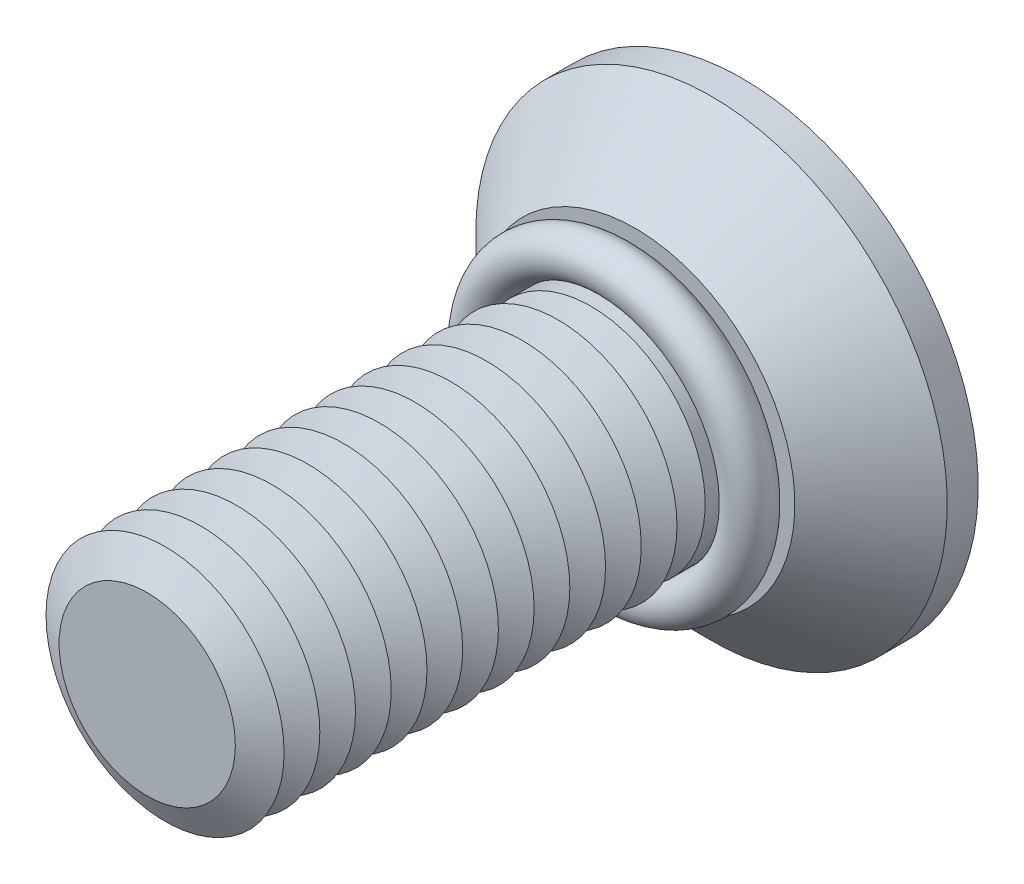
ISO-10303-21;
HEADER;
FILE_DESCRIPTION(('STEP AP214'),'2;1');
FILE_NAME('part.step','',(''),(''),'','','');
FILE_SCHEMA(('AUTOMOTIVE_DESIGN { 1 0 10303 214 1 1 1 1 }'));
ENDSEC;
DATA;
#1=APPLICATION_CONTEXT('core data for automotive mechanical design processes');
#2=APPLICATION_PROTOCOL_DEFINITION('international standard','automotive_design',2000,#1);
#3=PRODUCT_CONTEXT('',#1,'mechanical');
#4=PRODUCT('Part','Part','',(#3));
#5=PRODUCT_RELATED_PRODUCT_CATEGORY('part','',(#4));
#6=PRODUCT_DEFINITION_FORMATION('','',#4);
#7=PRODUCT_DEFINITION_CONTEXT('part definition',#1,'design');
#8=PRODUCT_DEFINITION('design','',#6,#7);
#9=PRODUCT_DEFINITION_SHAPE('','',#8);
#10=(LENGTH_UNIT() NAMED_UNIT(*) SI_UNIT(.MILLI.,.METRE.));
#11=(NAMED_UNIT(*) PLANE_ANGLE_UNIT() SI_UNIT($,.RADIAN.));
#12=(NAMED_UNIT(*) SI_UNIT($,.STERADIAN.) SOLID_ANGLE_UNIT());
#13=UNCERTAINTY_MEASURE_WITH_UNIT(LENGTH_MEASURE(1.E-05),#10,'distance_accuracy_value','');
#14=(GEOMETRIC_REPRESENTATION_CONTEXT(3) GLOBAL_UNCERTAINTY_ASSIGNED_CONTEXT((#13)) GLOBAL_UNIT_ASSIGNED_CONTEXT((#10,
#11,#12)) REPRESENTATION_CONTEXT('',''));
#15=CARTESIAN_POINT('',(0.,0.,0.));
#16=DIRECTION('',(0.,0.,1.));
#17=DIRECTION('',(1.,0.,0.));
#18=AXIS2_PLACEMENT_3D('',#15,#16,#17);
#19=CARTESIAN_POINT('',(0.,0.,5.39999999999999));
#20=DIRECTION('',(0.,0.,1.));
#21=DIRECTION('',(1.,0.,0.));
#22=AXIS2_PLACEMENT_3D('',#19,#20,#21);
#23=TOROIDAL_SURFACE('',#22,5.7,0.9);
#24=CARTESIAN_POINT('',(0.,5.7,5.39999999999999));
#25=DIRECTION('',(1.,0.,0.));
#26=DIRECTION('',(0.,0.,-1.));
#27=AXIS2_PLACEMENT_3D('',#24,#25,#26);
#28=CIRCLE('',#27,0.9);
#29=CARTESIAN_POINT('',(0.,6.6,5.39999999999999));
#30=VERTEX_POINT('',#29);
#31=EDGE_CURVE('P0_E10',#30,#30,#28,.T.);
#32=CARTESIAN_POINT('',(0.,0.,5.39999999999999));
#33=DIRECTION('',(0.,0.,1.));
#34=DIRECTION('',(1.,0.,0.));
#35=AXIS2_PLACEMENT_3D('',#32,#33,#34);
#36=CIRCLE('',#35,6.6);
#37=EDGE_CURVE('',#30,#30,#36,.T.);
#38=ORIENTED_EDGE('',*,*,#31,.F.);
#39=ORIENTED_EDGE('',*,*,#31,.T.);
#40=ORIENTED_EDGE('',*,*,#37,.T.);
#41=ORIENTED_EDGE('',*,*,#37,.F.);
#42=EDGE_LOOP('',(#38,#40,#39,#41));
#43=FACE_BOUND('',#42,.T.);
#44=ADVANCED_FACE('P0_F14',(#43),#23,.T.);
#45=CLOSED_SHELL('',(#44));
#46=MANIFOLD_SOLID_BREP('P0_B1',#45);
#47=CARTESIAN_POINT('',(0.,0.,17.5));
#48=DIRECTION('',(0.,0.,-1.));
#49=DIRECTION('',(-1.,0.,0.));
#50=AXIS2_PLACEMENT_3D('',#47,#48,#49);
#51=CONICAL_SURFACE('',#50,3.70096189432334,1.0471975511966);
#52=CARTESIAN_POINT('',(0.,0.,16.75));
#53=DIRECTION('',(0.,0.,1.));
#54=DIRECTION('',(1.,0.,0.));
#55=AXIS2_PLACEMENT_3D('',#52,#53,#54);
#56=CIRCLE('',#55,5.);
#57=CARTESIAN_POINT('',(5.,0.,16.75));
#58=VERTEX_POINT('',#57);
#59=EDGE_CURVE('P1_E324',#58,#58,#56,.T.);
#60=ORIENTED_EDGE('',*,*,#59,.T.);
#61=EDGE_LOOP('',(#60));
#62=FACE_BOUND('',#61,.T.);
#63=CARTESIAN_POINT('',(0.,0.,17.5));
#64=DIRECTION('',(0.,0.,1.));
#65=DIRECTION('',(1.,0.,0.));
#66=AXIS2_PLACEMENT_3D('',#63,#64,#65);
#67=CIRCLE('',#66,3.70096189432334);
#68=CARTESIAN_POINT('',(3.70096189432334,0.,17.5));
#69=VERTEX_POINT('',#68);
#70=EDGE_CURVE('P1_E321',#69,#69,#67,.T.);
#71=ORIENTED_EDGE('',*,*,#70,.F.);
#72=EDGE_LOOP('',(#71));
#73=FACE_BOUND('',#72,.T.);
#74=ADVANCED_FACE('P1_F15',(#62,#73),#51,.T.);
#75=CARTESIAN_POINT('',(0.,0.,18.25));
#76=DIRECTION('',(0.,0.,1.));
#77=DIRECTION('',(1.,0.,0.));
#78=AXIS2_PLACEMENT_3D('',#75,#76,#77);
#79=CONICAL_SURFACE('',#78,5.,1.0471975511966);
#80=ORIENTED_EDGE('',*,*,#70,.T.);
#81=EDGE_LOOP('',(#80));
#82=FACE_BOUND('',#81,.T.);
#83=CARTESIAN_POINT('',(0.,0.,18.25));
#84=DIRECTION('',(0.,0.,1.));
#85=DIRECTION('',(1.,0.,0.));
#86=AXIS2_PLACEMENT_3D('',#83,#84,#85);
#87=CIRCLE('',#86,5.);
#88=CARTESIAN_POINT('',(5.,0.,18.25));
#89=VERTEX_POINT('',#88);
#90=EDGE_CURVE('P1_E318',#89,#89,#87,.T.);
#91=ORIENTED_EDGE('',*,*,#90,.F.);
#92=EDGE_LOOP('',(#91));
#93=FACE_BOUND('',#92,.T.);
#94=ADVANCED_FACE('P1_F245',(#82,#93),#79,.T.);
#95=CARTESIAN_POINT('',(0.,0.,25.));
#96=DIRECTION('',(0.,0.,1.));
#97=DIRECTION('',(1.,0.,0.));
#98=AXIS2_PLACEMENT_3D('',#95,#96,#97);
#99=PLANE('',#98);
#100=CARTESIAN_POINT('',(0.,0.,25.));
#101=DIRECTION('',(0.,0.,1.));
#102=DIRECTION('',(1.,0.,0.));
#103=AXIS2_PLACEMENT_3D('',#100,#101,#102);
#104=CIRCLE('',#103,3.70096189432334);
#105=CARTESIAN_POINT('',(3.70096189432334,0.,25.));
#106=VERTEX_POINT('',#105);
#107=EDGE_CURVE('P1_E131',#106,#106,#104,.T.);
#108=ORIENTED_EDGE('',*,*,#107,.T.);
#109=EDGE_LOOP('',(#108));
#110=FACE_BOUND('',#109,.T.);
#111=ADVANCED_FACE('P1_F251',(#110),#99,.T.);
#112=CARTESIAN_POINT('',(0.,0.,25.));
#113=DIRECTION('',(0.,0.,-1.));
#114=DIRECTION('',(-1.,0.,0.));
#115=AXIS2_PLACEMENT_3D('',#112,#113,#114);
#116=CONICAL_SURFACE('',#115,3.70096189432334,1.0471975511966);
#117=CARTESIAN_POINT('',(0.,0.,24.25));
#118=DIRECTION('',(0.,0.,1.));
#119=DIRECTION('',(1.,0.,0.));
#120=AXIS2_PLACEMENT_3D('',#117,#118,#119);
#121=CIRCLE('',#120,5.);
#122=CARTESIAN_POINT('',(5.,0.,24.25));
#123=VERTEX_POINT('',#122);
#124=EDGE_CURVE('P1_E133',#123,#123,#121,.T.);
#125=ORIENTED_EDGE('',*,*,#124,.T.);
#126=EDGE_LOOP('',(#125));
#127=FACE_BOUND('',#126,.T.);
#128=ORIENTED_EDGE('',*,*,#107,.F.);
#129=EDGE_LOOP('',(#128));
#130=FACE_BOUND('',#129,.T.);
#131=ADVANCED_FACE('P1_F196',(#127,#130),#116,.T.);
#132=CARTESIAN_POINT('',(0.,0.,24.25));
#133=DIRECTION('',(0.,0.,1.));
#134=DIRECTION('',(1.,0.,0.));
#135=AXIS2_PLACEMENT_3D('',#132,#133,#134);
#136=CONICAL_SURFACE('',#135,5.,1.0471975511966);
#137=CARTESIAN_POINT('',(0.,0.,23.5));
#138=DIRECTION('',(0.,0.,1.));
#139=DIRECTION('',(1.,0.,0.));
#140=AXIS2_PLACEMENT_3D('',#137,#138,#139);
#141=CIRCLE('',#140,3.70096189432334);
#142=CARTESIAN_POINT('',(3.70096189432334,0.,23.5));
#143=VERTEX_POINT('',#142);
#144=EDGE_CURVE('P1_E297',#143,#143,#141,.T.);
#145=ORIENTED_EDGE('',*,*,#144,.T.);
#146=EDGE_LOOP('',(#145));
#147=FACE_BOUND('',#146,.T.);
#148=ORIENTED_EDGE('',*,*,#124,.F.);
#149=EDGE_LOOP('',(#148));
#150=FACE_BOUND('',#149,.T.);
#151=ADVANCED_FACE('P1_F284',(#147,#150),#136,.T.);
#152=CARTESIAN_POINT('',(0.,0.,23.5));
#153=DIRECTION('',(0.,0.,-1.));
#154=DIRECTION('',(-1.,0.,0.));
#155=AXIS2_PLACEMENT_3D('',#152,#153,#154);
#156=CONICAL_SURFACE('',#155,3.70096189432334,1.0471975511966);
#157=CARTESIAN_POINT('',(0.,0.,22.75));
#158=DIRECTION('',(0.,0.,1.));
#159=DIRECTION('',(1.,0.,0.));
#160=AXIS2_PLACEMENT_3D('',#157,#158,#159);
#161=CIRCLE('',#160,5.);
#162=CARTESIAN_POINT('',(5.,0.,22.75));
#163=VERTEX_POINT('',#162);
#164=EDGE_CURVE('P1_E294',#163,#163,#161,.T.);
#165=ORIENTED_EDGE('',*,*,#164,.T.);
#166=EDGE_LOOP('',(#165));
#167=FACE_BOUND('',#166,.T.);
#168=ORIENTED_EDGE('',*,*,#144,.F.);
#169=EDGE_LOOP('',(#168));
#170=FACE_BOUND('',#169,.T.);
#171=ADVANCED_FACE('P1_F279',(#167,#170),#156,.T.);
#172=CARTESIAN_POINT('',(0.,0.,22.75));
#173=DIRECTION('',(0.,0.,1.));
#174=DIRECTION('',(1.,0.,0.));
#175=AXIS2_PLACEMENT_3D('',#172,#173,#174);
#176=CONICAL_SURFACE('',#175,5.,1.0471975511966);
#177=CARTESIAN_POINT('',(0.,0.,22.));
#178=DIRECTION('',(0.,0.,1.));
#179=DIRECTION('',(1.,0.,0.));
#180=AXIS2_PLACEMENT_3D('',#177,#178,#179);
#181=CIRCLE('',#180,3.70096189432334);
#182=CARTESIAN_POINT('',(3.70096189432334,0.,22.));
#183=VERTEX_POINT('',#182);
#184=EDGE_CURVE('P1_E301',#183,#183,#181,.T.);
#185=ORIENTED_EDGE('',*,*,#184,.T.);
#186=EDGE_LOOP('',(#185));
#187=FACE_BOUND('',#186,.T.);
#188=ORIENTED_EDGE('',*,*,#164,.F.);
#189=EDGE_LOOP('',(#188));
#190=FACE_BOUND('',#189,.T.);
#191=ADVANCED_FACE('P1_F276',(#187,#190),#176,.T.);
#192=CARTESIAN_POINT('',(0.,0.,22.));
#193=DIRECTION('',(0.,0.,-1.));
#194=DIRECTION('',(-1.,0.,0.));
#195=AXIS2_PLACEMENT_3D('',#192,#193,#194);
#196=CONICAL_SURFACE('',#195,3.70096189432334,1.0471975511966);
#197=CARTESIAN_POINT('',(0.,0.,21.25));
#198=DIRECTION('',(0.,0.,1.));
#199=DIRECTION('',(1.,0.,0.));
#200=AXIS2_PLACEMENT_3D('',#197,#198,#199);
#201=CIRCLE('',#200,5.);
#202=CARTESIAN_POINT('',(5.,0.,21.25));
#203=VERTEX_POINT('',#202);
#204=EDGE_CURVE('P1_E306',#203,#203,#201,.T.);
#205=ORIENTED_EDGE('',*,*,#204,.T.);
#206=EDGE_LOOP('',(#205));
#207=FACE_BOUND('',#206,.T.);
#208=ORIENTED_EDGE('',*,*,#184,.F.);
#209=EDGE_LOOP('',(#208));
#210=FACE_BOUND('',#209,.T.);
#211=ADVANCED_FACE('P1_F271',(#207,#210),#196,.T.);
#212=CARTESIAN_POINT('',(0.,0.,21.25));
#213=DIRECTION('',(0.,0.,1.));
#214=DIRECTION('',(1.,0.,0.));
#215=AXIS2_PLACEMENT_3D('',#212,#213,#214);
#216=CONICAL_SURFACE('',#215,5.,1.0471975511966);
#217=CARTESIAN_POINT('',(0.,0.,20.5));
#218=DIRECTION('',(0.,0.,1.));
#219=DIRECTION('',(1.,0.,0.));
#220=AXIS2_PLACEMENT_3D('',#217,#218,#219);
#221=CIRCLE('',#220,3.70096189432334);
#222=CARTESIAN_POINT('',(3.70096189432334,0.,20.5));
#223=VERTEX_POINT('',#222);
#224=EDGE_CURVE('P1_E309',#223,#223,#221,.T.);
#225=ORIENTED_EDGE('',*,*,#224,.T.);
#226=EDGE_LOOP('',(#225));
#227=FACE_BOUND('',#226,.T.);
#228=ORIENTED_EDGE('',*,*,#204,.F.);
#229=EDGE_LOOP('',(#228));
#230=FACE_BOUND('',#229,.T.);
#231=ADVANCED_FACE('P1_F268',(#227,#230),#216,.T.);
#232=CARTESIAN_POINT('',(0.,0.,20.5));
#233=DIRECTION('',(0.,0.,-1.));
#234=DIRECTION('',(-1.,0.,0.));
#235=AXIS2_PLACEMENT_3D('',#232,#233,#234);
#236=CONICAL_SURFACE('',#235,3.70096189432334,1.0471975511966);
#237=CARTESIAN_POINT('',(0.,0.,19.75));
#238=DIRECTION('',(0.,0.,1.));
#239=DIRECTION('',(1.,0.,0.));
#240=AXIS2_PLACEMENT_3D('',#237,#238,#239);
#241=CIRCLE('',#240,5.);
#242=CARTESIAN_POINT('',(5.,0.,19.75));
#243=VERTEX_POINT('',#242);
#244=EDGE_CURVE('P1_E312',#243,#243,#241,.T.);
#245=ORIENTED_EDGE('',*,*,#244,.T.);
#246=EDGE_LOOP('',(#245));
#247=FACE_BOUND('',#246,.T.);
#248=ORIENTED_EDGE('',*,*,#224,.F.);
#249=EDGE_LOOP('',(#248));
#250=FACE_BOUND('',#249,.T.);
#251=ADVANCED_FACE('P1_F262',(#247,#250),#236,.T.);
#252=CARTESIAN_POINT('',(0.,0.,19.75));
#253=DIRECTION('',(0.,0.,1.));
#254=DIRECTION('',(1.,0.,0.));
#255=AXIS2_PLACEMENT_3D('',#252,#253,#254);
#256=CONICAL_SURFACE('',#255,5.,1.0471975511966);
#257=CARTESIAN_POINT('',(0.,0.,19.));
#258=DIRECTION('',(0.,0.,1.));
#259=DIRECTION('',(1.,0.,0.));
#260=AXIS2_PLACEMENT_3D('',#257,#258,#259);
#261=CIRCLE('',#260,3.70096189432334);
#262=CARTESIAN_POINT('',(3.70096189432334,0.,19.));
#263=VERTEX_POINT('',#262);
#264=EDGE_CURVE('P1_E315',#263,#263,#261,.T.);
#265=ORIENTED_EDGE('',*,*,#264,.T.);
#266=EDGE_LOOP('',(#265));
#267=FACE_BOUND('',#266,.T.);
#268=ORIENTED_EDGE('',*,*,#244,.F.);
#269=EDGE_LOOP('',(#268));
#270=FACE_BOUND('',#269,.T.);
#271=ADVANCED_FACE('P1_F258',(#267,#270),#256,.T.);
#272=CARTESIAN_POINT('',(0.,0.,19.));
#273=DIRECTION('',(0.,0.,-1.));
#274=DIRECTION('',(-1.,0.,0.));
#275=AXIS2_PLACEMENT_3D('',#272,#273,#274);
#276=CONICAL_SURFACE('',#275,3.70096189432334,1.0471975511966);
#277=ORIENTED_EDGE('',*,*,#90,.T.);
#278=EDGE_LOOP('',(#277));
#279=FACE_BOUND('',#278,.T.);
#280=ORIENTED_EDGE('',*,*,#264,.F.);
#281=EDGE_LOOP('',(#280));
#282=FACE_BOUND('',#281,.T.);
#283=ADVANCED_FACE('P1_F261',(#279,#282),#276,.T.);
#284=CARTESIAN_POINT('',(0.,0.,16.));
#285=DIRECTION('',(0.,0.,-1.));
#286=DIRECTION('',(-1.,0.,0.));
#287=AXIS2_PLACEMENT_3D('',#284,#285,#286);
#288=CONICAL_SURFACE('',#287,3.70096189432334,1.0471975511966);
#289=CARTESIAN_POINT('',(0.,0.,15.25));
#290=DIRECTION('',(0.,0.,1.));
#291=DIRECTION('',(1.,0.,0.));
#292=AXIS2_PLACEMENT_3D('',#289,#290,#291);
#293=CIRCLE('',#292,5.);
#294=CARTESIAN_POINT('',(5.,0.,15.25));
#295=VERTEX_POINT('',#294);
#296=EDGE_CURVE('P1_E329',#295,#295,#293,.T.);
#297=ORIENTED_EDGE('',*,*,#296,.T.);
#298=EDGE_LOOP('',(#297));
#299=FACE_BOUND('',#298,.T.);
#300=CARTESIAN_POINT('',(0.,0.,16.));
#301=DIRECTION('',(0.,0.,1.));
#302=DIRECTION('',(1.,0.,0.));
#303=AXIS2_PLACEMENT_3D('',#300,#301,#302);
#304=CIRCLE('',#303,3.70096189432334);
#305=CARTESIAN_POINT('',(3.70096189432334,0.,16.));
#306=VERTEX_POINT('',#305);
#307=EDGE_CURVE('P1_E326',#306,#306,#304,.T.);
#308=ORIENTED_EDGE('',*,*,#307,.F.);
#309=EDGE_LOOP('',(#308));
#310=FACE_BOUND('',#309,.T.);
#311=ADVANCED_FACE('P1_F266',(#299,#310),#288,.T.);
#312=CARTESIAN_POINT('',(0.,0.,16.75));
#313=DIRECTION('',(0.,0.,1.));
#314=DIRECTION('',(1.,0.,0.));
#315=AXIS2_PLACEMENT_3D('',#312,#313,#314);
#316=CONICAL_SURFACE('',#315,5.,1.0471975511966);
#317=ORIENTED_EDGE('',*,*,#307,.T.);
#318=EDGE_LOOP('',(#317));
#319=FACE_BOUND('',#318,.T.);
#320=ORIENTED_EDGE('',*,*,#59,.F.);
#321=EDGE_LOOP('',(#320));
#322=FACE_BOUND('',#321,.T.);
#323=ADVANCED_FACE('P1_F467',(#319,#322),#316,.T.);
#324=CARTESIAN_POINT('',(0.,0.,14.5));
#325=DIRECTION('',(0.,0.,-1.));
#326=DIRECTION('',(-1.,0.,0.));
#327=AXIS2_PLACEMENT_3D('',#324,#325,#326);
#328=CONICAL_SURFACE('',#327,3.70096189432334,1.0471975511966);
#329=CARTESIAN_POINT('',(0.,0.,13.75));
#330=DIRECTION('',(0.,0.,1.));
#331=DIRECTION('',(1.,0.,0.));
#332=AXIS2_PLACEMENT_3D('',#329,#330,#331);
#333=CIRCLE('',#332,5.);
#334=CARTESIAN_POINT('',(5.,0.,13.75));
#335=VERTEX_POINT('',#334);
#336=EDGE_CURVE('P1_E335',#335,#335,#333,.T.);
#337=ORIENTED_EDGE('',*,*,#336,.T.);
#338=EDGE_LOOP('',(#337));
#339=FACE_BOUND('',#338,.T.);
#340=CARTESIAN_POINT('',(0.,0.,14.5));
#341=DIRECTION('',(0.,0.,1.));
#342=DIRECTION('',(1.,0.,0.));
#343=AXIS2_PLACEMENT_3D('',#340,#341,#342);
#344=CIRCLE('',#343,3.70096189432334);
#345=CARTESIAN_POINT('',(3.70096189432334,0.,14.5));
#346=VERTEX_POINT('',#345);
#347=EDGE_CURVE('P1_E332',#346,#346,#344,.T.);
#348=ORIENTED_EDGE('',*,*,#347,.F.);
#349=EDGE_LOOP('',(#348));
#350=FACE_BOUND('',#349,.T.);
#351=ADVANCED_FACE('P1_F476',(#339,#350),#328,.T.);
#352=CARTESIAN_POINT('',(0.,0.,15.25));
#353=DIRECTION('',(0.,0.,1.));
#354=DIRECTION('',(1.,0.,0.));
#355=AXIS2_PLACEMENT_3D('',#352,#353,#354);
#356=CONICAL_SURFACE('',#355,5.,1.0471975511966);
#357=ORIENTED_EDGE('',*,*,#347,.T.);
#358=EDGE_LOOP('',(#357));
#359=FACE_BOUND('',#358,.T.);
#360=ORIENTED_EDGE('',*,*,#296,.F.);
#361=EDGE_LOOP('',(#360));
#362=FACE_BOUND('',#361,.T.);
#363=ADVANCED_FACE('P1_F486',(#359,#362),#356,.T.);
#364=CARTESIAN_POINT('',(0.,0.,13.));
#365=DIRECTION('',(0.,0.,-1.));
#366=DIRECTION('',(-1.,0.,0.));
#367=AXIS2_PLACEMENT_3D('',#364,#365,#366);
#368=CONICAL_SURFACE('',#367,3.70096189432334,1.0471975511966);
#369=CARTESIAN_POINT('',(0.,0.,12.25));
#370=DIRECTION('',(0.,0.,1.));
#371=DIRECTION('',(1.,0.,0.));
#372=AXIS2_PLACEMENT_3D('',#369,#370,#371);
#373=CIRCLE('',#372,5.);
#374=CARTESIAN_POINT('',(5.,0.,12.25));
#375=VERTEX_POINT('',#374);
#376=EDGE_CURVE('P1_E341',#375,#375,#373,.T.);
#377=ORIENTED_EDGE('',*,*,#376,.T.);
#378=EDGE_LOOP('',(#377));
#379=FACE_BOUND('',#378,.T.);
#380=CARTESIAN_POINT('',(0.,0.,13.));
#381=DIRECTION('',(0.,0.,1.));
#382=DIRECTION('',(1.,0.,0.));
#383=AXIS2_PLACEMENT_3D('',#380,#381,#382);
#384=CIRCLE('',#383,3.70096189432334);
#385=CARTESIAN_POINT('',(3.70096189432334,0.,13.));
#386=VERTEX_POINT('',#385);
#387=EDGE_CURVE('P1_E338',#386,#386,#384,.T.);
#388=ORIENTED_EDGE('',*,*,#387,.F.);
#389=EDGE_LOOP('',(#388));
#390=FACE_BOUND('',#389,.T.);
#391=ADVANCED_FACE('P1_F496',(#379,#390),#368,.T.);
#392=CARTESIAN_POINT('',(0.,0.,13.75));
#393=DIRECTION('',(0.,0.,1.));
#394=DIRECTION('',(1.,0.,0.));
#395=AXIS2_PLACEMENT_3D('',#392,#393,#394);
#396=CONICAL_SURFACE('',#395,5.,1.0471975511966);
#397=ORIENTED_EDGE('',*,*,#387,.T.);
#398=EDGE_LOOP('',(#397));
#399=FACE_BOUND('',#398,.T.);
#400=ORIENTED_EDGE('',*,*,#336,.F.);
#401=EDGE_LOOP('',(#400));
#402=FACE_BOUND('',#401,.T.);
#403=ADVANCED_FACE('P1_F506',(#399,#402),#396,.T.);
#404=CARTESIAN_POINT('',(0.,0.,11.5));
#405=DIRECTION('',(0.,0.,-1.));
#406=DIRECTION('',(-1.,0.,0.));
#407=AXIS2_PLACEMENT_3D('',#404,#405,#406);
#408=CONICAL_SURFACE('',#407,3.70096189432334,1.0471975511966);
#409=CARTESIAN_POINT('',(0.,0.,10.75));
#410=DIRECTION('',(0.,0.,1.));
#411=DIRECTION('',(1.,0.,0.));
#412=AXIS2_PLACEMENT_3D('',#409,#410,#411);
#413=CIRCLE('',#412,5.);
#414=CARTESIAN_POINT('',(5.,0.,10.75));
#415=VERTEX_POINT('',#414);
#416=EDGE_CURVE('P1_E347',#415,#415,#413,.T.);
#417=ORIENTED_EDGE('',*,*,#416,.T.);
#418=EDGE_LOOP('',(#417));
#419=FACE_BOUND('',#418,.T.);
#420=CARTESIAN_POINT('',(0.,0.,11.5));
#421=DIRECTION('',(0.,0.,1.));
#422=DIRECTION('',(1.,0.,0.));
#423=AXIS2_PLACEMENT_3D('',#420,#421,#422);
#424=CIRCLE('',#423,3.70096189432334);
#425=CARTESIAN_POINT('',(3.70096189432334,0.,11.5));
#426=VERTEX_POINT('',#425);
#427=EDGE_CURVE('P1_E344',#426,#426,#424,.T.);
#428=ORIENTED_EDGE('',*,*,#427,.F.);
#429=EDGE_LOOP('',(#428));
#430=FACE_BOUND('',#429,.T.);
#431=ADVANCED_FACE('P1_F516',(#419,#430),#408,.T.);
#432=CARTESIAN_POINT('',(0.,0.,12.25));
#433=DIRECTION('',(0.,0.,1.));
#434=DIRECTION('',(1.,0.,0.));
#435=AXIS2_PLACEMENT_3D('',#432,#433,#434);
#436=CONICAL_SURFACE('',#435,5.,1.0471975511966);
#437=ORIENTED_EDGE('',*,*,#427,.T.);
#438=EDGE_LOOP('',(#437));
#439=FACE_BOUND('',#438,.T.);
#440=ORIENTED_EDGE('',*,*,#376,.F.);
#441=EDGE_LOOP('',(#440));
#442=FACE_BOUND('',#441,.T.);
#443=ADVANCED_FACE('P1_F526',(#439,#442),#436,.T.);
#444=CARTESIAN_POINT('',(0.,0.,10.));
#445=DIRECTION('',(0.,0.,-1.));
#446=DIRECTION('',(-1.,0.,0.));
#447=AXIS2_PLACEMENT_3D('',#444,#445,#446);
#448=CONICAL_SURFACE('',#447,3.70096189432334,1.0471975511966);
#449=CARTESIAN_POINT('',(0.,0.,9.25));
#450=DIRECTION('',(0.,0.,1.));
#451=DIRECTION('',(1.,0.,0.));
#452=AXIS2_PLACEMENT_3D('',#449,#450,#451);
#453=CIRCLE('',#452,5.);
#454=CARTESIAN_POINT('',(5.,0.,9.25));
#455=VERTEX_POINT('',#454);
#456=EDGE_CURVE('P1_E353',#455,#455,#453,.T.);
#457=ORIENTED_EDGE('',*,*,#456,.T.);
#458=EDGE_LOOP('',(#457));
#459=FACE_BOUND('',#458,.T.);
#460=CARTESIAN_POINT('',(0.,0.,10.));
#461=DIRECTION('',(0.,0.,1.));
#462=DIRECTION('',(1.,0.,0.));
#463=AXIS2_PLACEMENT_3D('',#460,#461,#462);
#464=CIRCLE('',#463,3.70096189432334);
#465=CARTESIAN_POINT('',(3.70096189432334,0.,10.));
#466=VERTEX_POINT('',#465);
#467=EDGE_CURVE('P1_E350',#466,#466,#464,.T.);
#468=ORIENTED_EDGE('',*,*,#467,.F.);
#469=EDGE_LOOP('',(#468));
#470=FACE_BOUND('',#469,.T.);
#471=ADVANCED_FACE('P1_F536',(#459,#470),#448,.T.);
#472=CARTESIAN_POINT('',(0.,0.,10.75));
#473=DIRECTION('',(0.,0.,1.));
#474=DIRECTION('',(1.,0.,0.));
#475=AXIS2_PLACEMENT_3D('',#472,#473,#474);
#476=CONICAL_SURFACE('',#475,5.,1.0471975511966);
#477=ORIENTED_EDGE('',*,*,#467,.T.);
#478=EDGE_LOOP('',(#477));
#479=FACE_BOUND('',#478,.T.);
#480=ORIENTED_EDGE('',*,*,#416,.F.);
#481=EDGE_LOOP('',(#480));
#482=FACE_BOUND('',#481,.T.);
#483=ADVANCED_FACE('P1_F546',(#479,#482),#476,.T.);
#484=CARTESIAN_POINT('',(0.,0.,8.5));
#485=DIRECTION('',(0.,0.,-1.));
#486=DIRECTION('',(-1.,0.,0.));
#487=AXIS2_PLACEMENT_3D('',#484,#485,#486);
#488=CONICAL_SURFACE('',#487,3.70096189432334,1.0471975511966);
#489=CARTESIAN_POINT('',(0.,0.,7.75));
#490=DIRECTION('',(0.,0.,1.));
#491=DIRECTION('',(1.,0.,0.));
#492=AXIS2_PLACEMENT_3D('',#489,#490,#491);
#493=CIRCLE('',#492,5.);
#494=CARTESIAN_POINT('',(5.,0.,7.75));
#495=VERTEX_POINT('',#494);
#496=EDGE_CURVE('P1_E359',#495,#495,#493,.T.);
#497=ORIENTED_EDGE('',*,*,#496,.T.);
#498=EDGE_LOOP('',(#497));
#499=FACE_BOUND('',#498,.T.);
#500=CARTESIAN_POINT('',(0.,0.,8.5));
#501=DIRECTION('',(0.,0.,1.));
#502=DIRECTION('',(1.,0.,0.));
#503=AXIS2_PLACEMENT_3D('',#500,#501,#502);
#504=CIRCLE('',#503,3.70096189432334);
#505=CARTESIAN_POINT('',(3.70096189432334,0.,8.5));
#506=VERTEX_POINT('',#505);
#507=EDGE_CURVE('P1_E356',#506,#506,#504,.T.);
#508=ORIENTED_EDGE('',*,*,#507,.F.);
#509=EDGE_LOOP('',(#508));
#510=FACE_BOUND('',#509,.T.);
#511=ADVANCED_FACE('P1_F556',(#499,#510),#488,.T.);
#512=CARTESIAN_POINT('',(0.,0.,9.25));
#513=DIRECTION('',(0.,0.,1.));
#514=DIRECTION('',(1.,0.,0.));
#515=AXIS2_PLACEMENT_3D('',#512,#513,#514);
#516=CONICAL_SURFACE('',#515,5.,1.0471975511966);
#517=ORIENTED_EDGE('',*,*,#507,.T.);
#518=EDGE_LOOP('',(#517));
#519=FACE_BOUND('',#518,.T.);
#520=ORIENTED_EDGE('',*,*,#456,.F.);
#521=EDGE_LOOP('',(#520));
#522=FACE_BOUND('',#521,.T.);
#523=ADVANCED_FACE('P1_F372',(#519,#522),#516,.T.);
#524=CARTESIAN_POINT('',(0.,0.,7.));
#525=DIRECTION('',(0.,0.,-1.));
#526=DIRECTION('',(-1.,0.,0.));
#527=AXIS2_PLACEMENT_3D('',#524,#525,#526);
#528=CONICAL_SURFACE('',#527,3.70096189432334,1.0471975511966);
#529=CARTESIAN_POINT('',(0.,0.,7.));
#530=DIRECTION('',(0.,0.,1.));
#531=DIRECTION('',(1.,0.,0.));
#532=AXIS2_PLACEMENT_3D('',#529,#530,#531);
#533=CIRCLE('',#532,3.70096189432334);
#534=CARTESIAN_POINT('',(3.70096189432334,0.,7.));
#535=VERTEX_POINT('',#534);
#536=EDGE_CURVE('P1_E362',#535,#535,#533,.T.);
#537=ORIENTED_EDGE('',*,*,#536,.F.);
#538=EDGE_LOOP('',(#537));
#539=FACE_BOUND('',#538,.T.);
#540=CARTESIAN_POINT('',(0.,0.,6.36547005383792));
#541=DIRECTION('',(0.,0.,-1.));
#542=DIRECTION('',(-1.,0.,0.));
#543=AXIS2_PLACEMENT_3D('',#540,#541,#542);
#544=CIRCLE('',#543,4.8);
#545=CARTESIAN_POINT('',(-4.8,0.,6.36547005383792));
#546=VERTEX_POINT('',#545);
#547=EDGE_CURVE('P1_E19',#546,#546,#544,.F.);
#548=ORIENTED_EDGE('',*,*,#547,.T.);
#549=EDGE_LOOP('',(#548));
#550=FACE_BOUND('',#549,.T.);
#551=ADVANCED_FACE('P1_F369',(#539,#550),#528,.T.);
#552=CARTESIAN_POINT('',(0.,0.,7.75));
#553=DIRECTION('',(0.,0.,1.));
#554=DIRECTION('',(1.,0.,0.));
#555=AXIS2_PLACEMENT_3D('',#552,#553,#554);
#556=CONICAL_SURFACE('',#555,5.,1.0471975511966);
#557=ORIENTED_EDGE('',*,*,#536,.T.);
#558=EDGE_LOOP('',(#557));
#559=FACE_BOUND('',#558,.T.);
#560=ORIENTED_EDGE('',*,*,#496,.F.);
#561=EDGE_LOOP('',(#560));
#562=FACE_BOUND('',#561,.T.);
#563=ADVANCED_FACE('P1_F366',(#559,#562),#556,.T.);
#564=CARTESIAN_POINT('',(0.,0.,4.));
#565=DIRECTION('',(0.,0.,-1.));
#566=DIRECTION('',(-1.,0.,0.));
#567=AXIS2_PLACEMENT_3D('',#564,#565,#566);
#568=CONICAL_SURFACE('',#567,3.,1.0471975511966);
#569=CARTESIAN_POINT('',(0.,0.,5.73205080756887));
#570=VERTEX_POINT('',#569);
#571=VERTEX_LOOP('',#570);
#572=FACE_BOUND('',#571,.T.);
#573=CARTESIAN_POINT('',(0.,0.,4.));
#574=DIRECTION('',(0.,0.,-1.));
#575=DIRECTION('',(-1.,0.,0.));
#576=AXIS2_PLACEMENT_3D('',#573,#574,#575);
#577=CIRCLE('',#576,3.);
#578=CARTESIAN_POINT('',(-3.,0.,4.));
#579=VERTEX_POINT('',#578);
#580=CARTESIAN_POINT('',(-1.5,2.59807621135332,4.));
#581=VERTEX_POINT('',#580);
#582=EDGE_CURVE('P1_E117',#579,#581,#577,.T.);
#583=ORIENTED_EDGE('',*,*,#582,.T.);
#584=CARTESIAN_POINT('',(0.,0.,4.));
#585=DIRECTION('',(0.,0.,-1.));
#586=DIRECTION('',(-1.,0.,0.));
#587=AXIS2_PLACEMENT_3D('',#584,#585,#586);
#588=CIRCLE('',#587,3.);
#589=CARTESIAN_POINT('',(1.5,2.59807621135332,4.));
#590=VERTEX_POINT('',#589);
#591=EDGE_CURVE('P1_E24',#581,#590,#588,.T.);
#592=ORIENTED_EDGE('',*,*,#591,.T.);
#593=CARTESIAN_POINT('',(3.,0.,4.));
#594=VERTEX_POINT('',#593);
#595=EDGE_CURVE('P1_E791',#590,#594,#588,.T.);
#596=ORIENTED_EDGE('',*,*,#595,.T.);
#597=CARTESIAN_POINT('',(1.5,-2.59807621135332,4.));
#598=VERTEX_POINT('',#597);
#599=EDGE_CURVE('P1_E784',#594,#598,#588,.T.);
#600=ORIENTED_EDGE('',*,*,#599,.T.);
#601=CARTESIAN_POINT('',(-1.5,-2.59807621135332,4.));
#602=VERTEX_POINT('',#601);
#603=EDGE_CURVE('P1_E182',#598,#602,#588,.T.);
#604=ORIENTED_EDGE('',*,*,#603,.T.);
#605=EDGE_CURVE('P1_E179',#602,#579,#588,.T.);
#606=ORIENTED_EDGE('',*,*,#605,.T.);
#607=EDGE_LOOP('',(#583,#592,#596,#600,#604,#606));
#608=FACE_BOUND('',#607,.T.);
#609=ADVANCED_FACE('P1_F198',(#572,#608),#568,.F.);
#610=CARTESIAN_POINT('',(0.,0.,4.));
#611=DIRECTION('',(0.,0.,-1.));
#612=DIRECTION('',(-1.,0.,0.));
#613=AXIS2_PLACEMENT_3D('',#610,#611,#612);
#614=PLANE('',#613);
#615=ORIENTED_EDGE('',*,*,#603,.F.);
#616=DIRECTION('',(-0.866025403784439,-0.5,0.));
#617=VECTOR('',#616,1.);
#618=CARTESIAN_POINT('',(3.,-1.73205080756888,4.));
#619=LINE('',#618,#617);
#620=CARTESIAN_POINT('',(0.,-3.46410161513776,4.));
#621=VERTEX_POINT('',#620);
#622=EDGE_CURVE('P1_E800',#598,#621,#619,.T.);
#623=ORIENTED_EDGE('',*,*,#622,.T.);
#624=DIRECTION('',(-0.866025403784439,0.5,0.));
#625=VECTOR('',#624,1.);
#626=CARTESIAN_POINT('',(0.,-3.46410161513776,4.));
#627=LINE('',#626,#625);
#628=EDGE_CURVE('P1_E807',#621,#602,#627,.T.);
#629=ORIENTED_EDGE('',*,*,#628,.T.);
#630=EDGE_LOOP('',(#615,#623,#629));
#631=FACE_BOUND('',#630,.T.);
#632=ADVANCED_FACE('P1_F598',(#631),#614,.T.);
#633=ORIENTED_EDGE('',*,*,#605,.F.);
#634=CARTESIAN_POINT('',(-3.,-1.73205080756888,4.));
#635=VERTEX_POINT('',#634);
#636=EDGE_CURVE('P1_E810',#602,#635,#627,.T.);
#637=ORIENTED_EDGE('',*,*,#636,.T.);
#638=DIRECTION('',(0.,1.,0.));
#639=VECTOR('',#638,1.);
#640=CARTESIAN_POINT('',(-3.,-1.73205080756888,4.));
#641=LINE('',#640,#639);
#642=EDGE_CURVE('P1_E123',#635,#579,#641,.T.);
#643=ORIENTED_EDGE('',*,*,#642,.T.);
#644=EDGE_LOOP('',(#633,#637,#643));
#645=FACE_BOUND('',#644,.T.);
#646=ADVANCED_FACE('P1_F231',(#645),#614,.T.);
#647=ORIENTED_EDGE('',*,*,#582,.F.);
#648=CARTESIAN_POINT('',(-3.,1.73205080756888,4.));
#649=VERTEX_POINT('',#648);
#650=EDGE_CURVE('P1_E812',#579,#649,#641,.T.);
#651=ORIENTED_EDGE('',*,*,#650,.T.);
#652=DIRECTION('',(0.866025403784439,0.5,0.));
#653=VECTOR('',#652,1.);
#654=CARTESIAN_POINT('',(-3.,1.73205080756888,4.));
#655=LINE('',#654,#653);
#656=EDGE_CURVE('P1_E815',#649,#581,#655,.T.);
#657=ORIENTED_EDGE('',*,*,#656,.T.);
#658=EDGE_LOOP('',(#647,#651,#657));
#659=FACE_BOUND('',#658,.T.);
#660=ADVANCED_FACE('P1_F615',(#659),#614,.T.);
#661=ORIENTED_EDGE('',*,*,#591,.F.);
#662=CARTESIAN_POINT('',(0.,3.46410161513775,4.));
#663=VERTEX_POINT('',#662);
#664=EDGE_CURVE('P1_E814',#581,#663,#655,.T.);
#665=ORIENTED_EDGE('',*,*,#664,.T.);
#666=DIRECTION('',(0.866025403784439,-0.5,0.));
#667=VECTOR('',#666,1.);
#668=CARTESIAN_POINT('',(0.,3.46410161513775,4.));
#669=LINE('',#668,#667);
#670=EDGE_CURVE('P1_E161',#663,#590,#669,.T.);
#671=ORIENTED_EDGE('',*,*,#670,.T.);
#672=EDGE_LOOP('',(#661,#665,#671));
#673=FACE_BOUND('',#672,.T.);
#674=ADVANCED_FACE('P1_F624',(#673),#614,.T.);
#675=ORIENTED_EDGE('',*,*,#595,.F.);
#676=CARTESIAN_POINT('',(3.,1.73205080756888,4.));
#677=VERTEX_POINT('',#676);
#678=EDGE_CURVE('P1_E799',#590,#677,#669,.T.);
#679=ORIENTED_EDGE('',*,*,#678,.T.);
#680=DIRECTION('',(0.,-1.,0.));
#681=VECTOR('',#680,1.);
#682=CARTESIAN_POINT('',(3.,1.73205080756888,4.));
#683=LINE('',#682,#681);
#684=EDGE_CURVE('P1_E794',#677,#594,#683,.T.);
#685=ORIENTED_EDGE('',*,*,#684,.T.);
#686=EDGE_LOOP('',(#675,#679,#685));
#687=FACE_BOUND('',#686,.T.);
#688=ADVANCED_FACE('P1_F633',(#687),#614,.T.);
#689=ORIENTED_EDGE('',*,*,#599,.F.);
#690=CARTESIAN_POINT('',(3.,-1.73205080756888,4.));
#691=VERTEX_POINT('',#690);
#692=EDGE_CURVE('P1_E786',#594,#691,#683,.T.);
#693=ORIENTED_EDGE('',*,*,#692,.T.);
#694=EDGE_CURVE('P1_E125',#691,#598,#619,.T.);
#695=ORIENTED_EDGE('',*,*,#694,.T.);
#696=EDGE_LOOP('',(#689,#693,#695));
#697=FACE_BOUND('',#696,.T.);
#698=ADVANCED_FACE('P1_F229',(#697),#614,.T.);
#699=CARTESIAN_POINT('',(3.,-1.73205080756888,4.));
#700=DIRECTION('',(0.5,-0.866025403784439,0.));
#701=DIRECTION('',(0.866025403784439,0.5,0.));
#702=AXIS2_PLACEMENT_3D('',#699,#700,#701);
#703=PLANE('',#702);
#704=DIRECTION('',(0.,0.,-1.));
#705=VECTOR('',#704,1.);
#706=CARTESIAN_POINT('',(3.,-1.73205080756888,4.));
#707=LINE('',#706,#705);
#708=CARTESIAN_POINT('',(3.,-1.73205080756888,0.));
#709=VERTEX_POINT('',#708);
#710=EDGE_CURVE('P1_E164',#691,#709,#707,.T.);
#711=ORIENTED_EDGE('',*,*,#710,.T.);
#712=CARTESIAN_POINT('',(3.0002,-1.73193533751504,-3.09416546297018E-05));
#713=CARTESIAN_POINT('',(2.8756009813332,-1.80387261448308,0.0192538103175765));
#714=CARTESIAN_POINT('',(2.75077603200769,-1.87594033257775,0.0367612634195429));
#715=CARTESIAN_POINT('',(2.50068525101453,-2.02033031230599,0.0675203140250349));
#716=CARTESIAN_POINT('',(2.37541926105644,-2.0926526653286,0.08077018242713));
#717=CARTESIAN_POINT('',(2.12520598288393,-2.23711336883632,0.102240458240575));
#718=CARTESIAN_POINT('',(2.00026038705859,-2.30925074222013,0.110486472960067));
#719=CARTESIAN_POINT('',(1.75020983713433,-2.45361749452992,0.12154354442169));
#720=CARTESIAN_POINT('',(1.62510491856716,-2.52584685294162,0.124355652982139));
#721=CARTESIAN_POINT('',(1.37489508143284,-2.67030556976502,0.124355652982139));
#722=CARTESIAN_POINT('',(1.24979016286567,-2.74253492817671,0.12154354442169));
#723=CARTESIAN_POINT('',(0.99973961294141,-2.8869016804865,0.110486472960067));
#724=CARTESIAN_POINT('',(0.874794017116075,-2.95903905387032,0.102240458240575));
#725=CARTESIAN_POINT('',(0.624580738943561,-3.10349975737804,0.0807701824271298));
#726=CARTESIAN_POINT('',(0.499314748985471,-3.17582211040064,0.0675203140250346));
#727=CARTESIAN_POINT('',(0.24922396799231,-3.32021209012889,0.0367612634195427));
#728=CARTESIAN_POINT('',(0.124399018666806,-3.39227980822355,0.0192538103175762));
#729=CARTESIAN_POINT('',(-0.000199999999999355,-3.46421708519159,-3.09416546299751E-05));
#730=B_SPLINE_CURVE_WITH_KNOTS('',3,(#712,#713,#714,#715,#716,#717,#718,#719,#720,#721,#722,
#723,#724,#725,#726,#727,#728,#729),.UNSPECIFIED.,.F.,.F.,(4,2,2,2,2,2,2,2,4),(0.,
0.435506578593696,0.87118980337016,1.3046241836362,1.73797465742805,2.17132513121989,
2.60475951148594,3.0404427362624,3.4759493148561),.UNSPECIFIED.);
#731=CARTESIAN_POINT('',(0.,-3.46410161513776,0.));
#732=VERTEX_POINT('',#731);
#733=EDGE_CURVE('P1_E118',#709,#732,#730,.T.);
#734=ORIENTED_EDGE('',*,*,#733,.T.);
#735=DIRECTION('',(0.,0.,-1.));
#736=VECTOR('',#735,1.);
#737=CARTESIAN_POINT('',(0.,-3.46410161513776,4.));
#738=LINE('',#737,#736);
#739=EDGE_CURVE('P1_E116',#621,#732,#738,.T.);
#740=ORIENTED_EDGE('',*,*,#739,.F.);
#741=ORIENTED_EDGE('',*,*,#622,.F.);
#742=ORIENTED_EDGE('',*,*,#694,.F.);
#743=EDGE_LOOP('',(#711,#734,#740,#741,#742));
#744=FACE_BOUND('',#743,.T.);
#745=ADVANCED_FACE('P1_F226',(#744),#703,.F.);
#746=CARTESIAN_POINT('',(0.,-3.46410161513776,4.));
#747=DIRECTION('',(-0.5,-0.866025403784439,0.));
#748=DIRECTION('',(0.866025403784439,-0.5,0.));
#749=AXIS2_PLACEMENT_3D('',#746,#747,#748);
#750=PLANE('',#749);
#751=ORIENTED_EDGE('',*,*,#739,.T.);
#752=CARTESIAN_POINT('',(0.000200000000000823,-3.46421708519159,-3.09416546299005E-05));
#753=CARTESIAN_POINT('',(-0.124399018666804,-3.39227980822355,0.0192538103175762));
#754=CARTESIAN_POINT('',(-0.249223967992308,-3.32021209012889,0.0367612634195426));
#755=CARTESIAN_POINT('',(-0.49931474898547,-3.17582211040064,0.0675203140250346));
#756=CARTESIAN_POINT('',(-0.62458073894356,-3.10349975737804,0.0807701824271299));
#757=CARTESIAN_POINT('',(-0.874794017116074,-2.95903905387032,0.102240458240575));
#758=CARTESIAN_POINT('',(-0.999739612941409,-2.8869016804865,0.110486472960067));
#759=CARTESIAN_POINT('',(-1.24979016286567,-2.74253492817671,0.12154354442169));
#760=CARTESIAN_POINT('',(-1.37489508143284,-2.67030556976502,0.124355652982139));
#761=CARTESIAN_POINT('',(-1.62510491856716,-2.52584685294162,0.124355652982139));
#762=CARTESIAN_POINT('',(-1.75020983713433,-2.45361749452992,0.12154354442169));
#763=CARTESIAN_POINT('',(-2.00026038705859,-2.30925074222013,0.110486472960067));
#764=CARTESIAN_POINT('',(-2.12520598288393,-2.23711336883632,0.102240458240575));
#765=CARTESIAN_POINT('',(-2.37541926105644,-2.0926526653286,0.0807701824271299));
#766=CARTESIAN_POINT('',(-2.50068525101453,-2.02033031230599,0.0675203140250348));
#767=CARTESIAN_POINT('',(-2.75077603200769,-1.87594033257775,0.0367612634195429));
#768=CARTESIAN_POINT('',(-2.87560098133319,-1.80387261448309,0.0192538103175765));
#769=CARTESIAN_POINT('',(-3.0002,-1.73193533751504,-3.09416546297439E-05));
#770=B_SPLINE_CURVE_WITH_KNOTS('',3,(#752,#753,#754,#755,#756,#757,#758,#759,#760,#761,#762,
#763,#764,#765,#766,#767,#768,#769),.UNSPECIFIED.,.F.,.F.,(4,2,2,2,2,2,2,2,4),(0.,
0.435506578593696,0.87118980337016,1.3046241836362,1.73797465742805,2.17132513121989,
2.60475951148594,3.0404427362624,3.4759493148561),.UNSPECIFIED.);
#771=CARTESIAN_POINT('',(-3.,-1.73205080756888,0.));
#772=VERTEX_POINT('',#771);
#773=EDGE_CURVE('P1_E94',#732,#772,#770,.T.);
#774=ORIENTED_EDGE('',*,*,#773,.T.);
#775=DIRECTION('',(0.,0.,-1.));
#776=VECTOR('',#775,1.);
#777=CARTESIAN_POINT('',(-3.,-1.73205080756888,4.));
#778=LINE('',#777,#776);
#779=EDGE_CURVE('P1_E112',#635,#772,#778,.T.);
#780=ORIENTED_EDGE('',*,*,#779,.F.);
#781=ORIENTED_EDGE('',*,*,#636,.F.);
#782=ORIENTED_EDGE('',*,*,#628,.F.);
#783=EDGE_LOOP('',(#751,#774,#780,#781,#782));
#784=FACE_BOUND('',#783,.T.);
#785=ADVANCED_FACE('P1_F110',(#784),#750,.F.);
#786=CARTESIAN_POINT('',(-3.,-1.73205080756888,4.));
#787=DIRECTION('',(-1.,0.,0.));
#788=DIRECTION('',(0.,0.,1.));
#789=AXIS2_PLACEMENT_3D('',#786,#787,#788);
#790=PLANE('',#789);
#791=ORIENTED_EDGE('',*,*,#779,.T.);
#792=CARTESIAN_POINT('',(-3.,-4.52161137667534,-0.525775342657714));
#793=CARTESIAN_POINT('',(-3.,-4.3861469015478,-0.495537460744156));
#794=CARTESIAN_POINT('',(-3.,-4.25059605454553,-0.465680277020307));
#795=CARTESIAN_POINT('',(-3.,-3.97927914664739,-0.406931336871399));
#796=CARTESIAN_POINT('',(-3.,-3.84351307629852,-0.378039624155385));
#797=CARTESIAN_POINT('',(-3.,-3.57159492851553,-0.321399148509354));
#798=CARTESIAN_POINT('',(-3.,-3.43544259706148,-0.293651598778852));
#799=CARTESIAN_POINT('',(-3.,-3.16285056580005,-0.239614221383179));
#800=CARTESIAN_POINT('',(-3.,-3.02641086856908,-0.213324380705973));
#801=CARTESIAN_POINT('',(-3.,-2.61896324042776,-0.137569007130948));
#802=CARTESIAN_POINT('',(-3.,-2.34745999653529,-0.0907136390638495));
#803=CARTESIAN_POINT('',(-3.,-1.8027975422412,-0.0077090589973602));
#804=CARTESIAN_POINT('',(-3.,-1.52963867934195,0.0284423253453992));
#805=CARTESIAN_POINT('',(-3.,-1.11712206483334,0.0711149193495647));
#806=CARTESIAN_POINT('',(-3.,-0.978367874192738,0.0834493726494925));
#807=CARTESIAN_POINT('',(-3.,-0.700531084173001,0.103508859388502));
#808=CARTESIAN_POINT('',(-3.,-0.561448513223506,0.11123427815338));
#809=CARTESIAN_POINT('',(-3.,-0.283146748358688,0.121626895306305));
#810=CARTESIAN_POINT('',(-3.,-0.143927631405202,0.124296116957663));
#811=CARTESIAN_POINT('',(-3.,0.134513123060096,0.124413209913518));
#812=CARTESIAN_POINT('',(-3.,0.273734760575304,0.121861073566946));
#813=CARTESIAN_POINT('',(-3.,0.552556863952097,0.111676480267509));
#814=CARTESIAN_POINT('',(-3.,0.692156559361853,0.104023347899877));
#815=CARTESIAN_POINT('',(-3.,0.971024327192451,0.0840648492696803));
#816=CARTESIAN_POINT('',(-3.,1.11029238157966,0.0717592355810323));
#817=CARTESIAN_POINT('',(-3.,1.3884939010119,0.0431025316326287));
#818=CARTESIAN_POINT('',(-3.,1.52742710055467,0.0267489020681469));
#819=CARTESIAN_POINT('',(-3.,1.80484805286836,-0.00934194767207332));
#820=CARTESIAN_POINT('',(-3.,1.94333580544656,-0.0290791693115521));
#821=CARTESIAN_POINT('',(-3.,2.2235029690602,-0.0718742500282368));
#822=CARTESIAN_POINT('',(-3.,2.36517107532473,-0.0950054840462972));
#823=CARTESIAN_POINT('',(-3.,2.648104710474,-0.143617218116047));
#824=CARTESIAN_POINT('',(-3.,2.78937022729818,-0.169097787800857));
#825=CARTESIAN_POINT('',(-3.,3.21267286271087,-0.248342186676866));
#826=CARTESIAN_POINT('',(-3.,3.49418463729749,-0.304903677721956));
#827=CARTESIAN_POINT('',(-3.,4.05626646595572,-0.422827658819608));
#828=CARTESIAN_POINT('',(-3.,4.33683622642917,-0.484191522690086));
#829=CARTESIAN_POINT('',(-3.,4.89726247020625,-0.610112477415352));
#830=CARTESIAN_POINT('',(-3.,5.17711893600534,-0.674669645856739));
#831=CARTESIAN_POINT('',(-3.,5.73290235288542,-0.805171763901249));
#832=CARTESIAN_POINT('',(-3.,6.00883557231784,-0.871090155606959));
#833=CARTESIAN_POINT('',(-3.,6.56033924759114,-1.00445136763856));
#834=CARTESIAN_POINT('',(-3.,6.83590969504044,-1.07189422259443));
#835=CARTESIAN_POINT('',(-3.,7.38639195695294,-1.20779575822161));
#836=CARTESIAN_POINT('',(-3.,7.66130415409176,-1.27625289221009));
#837=CARTESIAN_POINT('',(-3.,8.21090603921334,-1.41401333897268));
#838=CARTESIAN_POINT('',(-3.,8.48559573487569,-1.48331662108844));
#839=CARTESIAN_POINT('',(-3.,8.76020986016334,-1.55291480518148));
#840=B_SPLINE_CURVE_WITH_KNOTS('',3,(#792,#793,#794,#795,#796,#797,#798,#799,#800,#801,#802,
#803,#804,#805,#806,#807,#808,#809,#810,#811,#812,#813,#814,#815,#816,#817,#818,#819,#820,#821,
#822,#823,#824,#825,#826,#827,#828,#829,#830,#831,#832,#833,#834,#835,#836,#837,#838,#839),
.UNSPECIFIED.,.F.,.F.,(4,2,2,2,2,2,2,2,2,2,2,2,2,2,2,2,2,2,2,2,2,2,2,4),(0.,0.416396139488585,
0.832811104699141,1.24965681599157,1.66649880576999,2.49292514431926,3.31918364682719,
3.73702338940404,4.1548281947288,4.57246577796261,4.99010397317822,5.40944532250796,
5.82880897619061,6.24843636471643,6.66806393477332,7.09867155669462,7.52929194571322,
8.39062817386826,9.25221171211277,10.1138161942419,10.9649037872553,11.8160107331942,
12.6659315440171,13.5158216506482),.UNSPECIFIED.);
#841=CARTESIAN_POINT('',(-3.,1.73205080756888,0.));
#842=VERTEX_POINT('',#841);
#843=EDGE_CURVE('P1_E10',#772,#842,#840,.T.);
#844=ORIENTED_EDGE('',*,*,#843,.T.);
#845=DIRECTION('',(0.,0.,-1.));
#846=VECTOR('',#845,1.);
#847=CARTESIAN_POINT('',(-3.,1.73205080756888,4.));
#848=LINE('',#847,#846);
#849=EDGE_CURVE('P1_E124',#649,#842,#848,.T.);
#850=ORIENTED_EDGE('',*,*,#849,.F.);
#851=ORIENTED_EDGE('',*,*,#650,.F.);
#852=ORIENTED_EDGE('',*,*,#642,.F.);
#853=EDGE_LOOP('',(#791,#844,#850,#851,#852));
#854=FACE_BOUND('',#853,.T.);
#855=ADVANCED_FACE('P1_F120',(#854),#790,.F.);
#856=CARTESIAN_POINT('',(-3.,1.73205080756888,4.));
#857=DIRECTION('',(-0.5,0.866025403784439,0.));
#858=DIRECTION('',(-0.866025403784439,-0.5,0.));
#859=AXIS2_PLACEMENT_3D('',#856,#857,#858);
#860=PLANE('',#859);
#861=ORIENTED_EDGE('',*,*,#849,.T.);
#862=CARTESIAN_POINT('',(-3.0002,1.73193533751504,-3.09416546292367E-05));
#863=CARTESIAN_POINT('',(-2.87560098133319,1.80387261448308,0.019253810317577));
#864=CARTESIAN_POINT('',(-2.75077603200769,1.87594033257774,0.0367612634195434));
#865=CARTESIAN_POINT('',(-2.50068525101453,2.02033031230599,0.0675203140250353));
#866=CARTESIAN_POINT('',(-2.37541926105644,2.0926526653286,0.0807701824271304));
#867=CARTESIAN_POINT('',(-2.12520598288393,2.23711336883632,0.102240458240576));
#868=CARTESIAN_POINT('',(-2.00026038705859,2.30925074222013,0.110486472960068));
#869=CARTESIAN_POINT('',(-1.75020983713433,2.45361749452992,0.121543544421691));
#870=CARTESIAN_POINT('',(-1.62510491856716,2.52584685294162,0.12435565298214));
#871=CARTESIAN_POINT('',(-1.37489508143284,2.67030556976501,0.12435565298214));
#872=CARTESIAN_POINT('',(-1.24979016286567,2.74253492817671,0.121543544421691));
#873=CARTESIAN_POINT('',(-0.999739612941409,2.8869016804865,0.110486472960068));
#874=CARTESIAN_POINT('',(-0.874794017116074,2.95903905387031,0.102240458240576));
#875=CARTESIAN_POINT('',(-0.62458073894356,3.10349975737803,0.0807701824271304));
#876=CARTESIAN_POINT('',(-0.499314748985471,3.17582211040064,0.0675203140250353));
#877=CARTESIAN_POINT('',(-0.249223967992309,3.32021209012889,0.0367612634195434));
#878=CARTESIAN_POINT('',(-0.124399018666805,3.39227980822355,0.0192538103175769));
#879=CARTESIAN_POINT('',(0.000199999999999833,3.46421708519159,-3.09416546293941E-05));
#880=B_SPLINE_CURVE_WITH_KNOTS('',3,(#862,#863,#864,#865,#866,#867,#868,#869,#870,#871,#872,
#873,#874,#875,#876,#877,#878,#879),.UNSPECIFIED.,.F.,.F.,(4,2,2,2,2,2,2,2,4),(0.,
0.435506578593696,0.87118980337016,1.3046241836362,1.73797465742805,2.17132513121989,
2.60475951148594,3.0404427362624,3.4759493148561),.UNSPECIFIED.);
#881=CARTESIAN_POINT('',(0.,3.46410161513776,0.));
#882=VERTEX_POINT('',#881);
#883=EDGE_CURVE('P1_E136',#842,#882,#880,.T.);
#884=ORIENTED_EDGE('',*,*,#883,.T.);
#885=DIRECTION('',(0.,0.,-1.));
#886=VECTOR('',#885,1.);
#887=CARTESIAN_POINT('',(0.,3.46410161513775,4.));
#888=LINE('',#887,#886);
#889=EDGE_CURVE('P1_E155',#663,#882,#888,.T.);
#890=ORIENTED_EDGE('',*,*,#889,.F.);
#891=ORIENTED_EDGE('',*,*,#664,.F.);
#892=ORIENTED_EDGE('',*,*,#656,.F.);
#893=EDGE_LOOP('',(#861,#884,#890,#891,#892));
#894=FACE_BOUND('',#893,.T.);
#895=ADVANCED_FACE('P1_F153',(#894),#860,.F.);
#896=CARTESIAN_POINT('',(0.,3.46410161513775,4.));
#897=DIRECTION('',(0.5,0.866025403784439,0.));
#898=DIRECTION('',(-0.866025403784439,0.5,0.));
#899=AXIS2_PLACEMENT_3D('',#896,#897,#898);
#900=PLANE('',#899);
#901=ORIENTED_EDGE('',*,*,#889,.T.);
#902=CARTESIAN_POINT('',(-0.000200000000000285,3.46421708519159,-3.09416546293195E-05));
#903=CARTESIAN_POINT('',(0.124399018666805,3.39227980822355,0.0192538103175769));
#904=CARTESIAN_POINT('',(0.249223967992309,3.32021209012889,0.0367612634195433));
#905=CARTESIAN_POINT('',(0.49931474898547,3.17582211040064,0.0675203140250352));
#906=CARTESIAN_POINT('',(0.62458073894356,3.10349975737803,0.0807701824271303));
#907=CARTESIAN_POINT('',(0.874794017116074,2.95903905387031,0.102240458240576));
#908=CARTESIAN_POINT('',(0.999739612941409,2.8869016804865,0.110486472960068));
#909=CARTESIAN_POINT('',(1.24979016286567,2.74253492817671,0.121543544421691));
#910=CARTESIAN_POINT('',(1.37489508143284,2.67030556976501,0.12435565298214));
#911=CARTESIAN_POINT('',(1.62510491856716,2.52584685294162,0.12435565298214));
#912=CARTESIAN_POINT('',(1.75020983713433,2.45361749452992,0.121543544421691));
#913=CARTESIAN_POINT('',(2.00026038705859,2.30925074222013,0.110486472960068));
#914=CARTESIAN_POINT('',(2.12520598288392,2.23711336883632,0.102240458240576));
#915=CARTESIAN_POINT('',(2.37541926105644,2.0926526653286,0.0807701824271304));
#916=CARTESIAN_POINT('',(2.50068525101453,2.02033031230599,0.0675203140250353));
#917=CARTESIAN_POINT('',(2.75077603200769,1.87594033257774,0.0367612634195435));
#918=CARTESIAN_POINT('',(2.87560098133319,1.80387261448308,0.019253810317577));
#919=CARTESIAN_POINT('',(3.0002,1.73193533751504,-3.09416546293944E-05));
#920=B_SPLINE_CURVE_WITH_KNOTS('',3,(#902,#903,#904,#905,#906,#907,#908,#909,#910,#911,#912,
#913,#914,#915,#916,#917,#918,#919),.UNSPECIFIED.,.F.,.F.,(4,2,2,2,2,2,2,2,4),(0.,
0.435506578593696,0.87118980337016,1.3046241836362,1.73797465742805,2.17132513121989,
2.60475951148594,3.0404427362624,3.4759493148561),.UNSPECIFIED.);
#921=CARTESIAN_POINT('',(3.,1.73205080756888,0.));
#922=VERTEX_POINT('',#921);
#923=EDGE_CURVE('P1_E141',#882,#922,#920,.T.);
#924=ORIENTED_EDGE('',*,*,#923,.T.);
#925=DIRECTION('',(0.,0.,-1.));
#926=VECTOR('',#925,1.);
#927=CARTESIAN_POINT('',(3.,1.73205080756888,4.));
#928=LINE('',#927,#926);
#929=EDGE_CURVE('P1_E162',#677,#922,#928,.T.);
#930=ORIENTED_EDGE('',*,*,#929,.F.);
#931=ORIENTED_EDGE('',*,*,#678,.F.);
#932=ORIENTED_EDGE('',*,*,#670,.F.);
#933=EDGE_LOOP('',(#901,#924,#930,#931,#932));
#934=FACE_BOUND('',#933,.T.);
#935=ADVANCED_FACE('P1_F158',(#934),#900,.F.);
#936=CARTESIAN_POINT('',(3.,1.73205080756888,4.));
#937=DIRECTION('',(1.,0.,0.));
#938=DIRECTION('',(0.,0.,-1.));
#939=AXIS2_PLACEMENT_3D('',#936,#937,#938);
#940=PLANE('',#939);
#941=ORIENTED_EDGE('',*,*,#929,.T.);
#942=CARTESIAN_POINT('',(3.,-4.52161137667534,-0.525775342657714));
#943=CARTESIAN_POINT('',(3.,-4.3861469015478,-0.495537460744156));
#944=CARTESIAN_POINT('',(3.,-4.25059605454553,-0.465680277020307));
#945=CARTESIAN_POINT('',(3.,-3.97927914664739,-0.406931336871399));
#946=CARTESIAN_POINT('',(3.,-3.84351307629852,-0.378039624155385));
#947=CARTESIAN_POINT('',(3.,-3.57159492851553,-0.321399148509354));
#948=CARTESIAN_POINT('',(3.,-3.43544259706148,-0.293651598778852));
#949=CARTESIAN_POINT('',(3.,-3.16285056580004,-0.239614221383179));
#950=CARTESIAN_POINT('',(3.,-3.02641086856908,-0.213324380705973));
#951=CARTESIAN_POINT('',(3.,-2.61896324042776,-0.137569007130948));
#952=CARTESIAN_POINT('',(3.,-2.34745999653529,-0.0907136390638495));
#953=CARTESIAN_POINT('',(3.,-1.80279754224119,-0.00770905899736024));
#954=CARTESIAN_POINT('',(3.,-1.52963867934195,0.0284423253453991));
#955=CARTESIAN_POINT('',(3.,-1.11712206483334,0.0711149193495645));
#956=CARTESIAN_POINT('',(3.,-0.978367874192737,0.0834493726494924));
#957=CARTESIAN_POINT('',(3.,-0.700531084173,0.103508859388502));
#958=CARTESIAN_POINT('',(3.,-0.561448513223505,0.11123427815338));
#959=CARTESIAN_POINT('',(3.,-0.283146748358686,0.121626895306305));
#960=CARTESIAN_POINT('',(3.,-0.143927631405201,0.124296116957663));
#961=CARTESIAN_POINT('',(3.,0.134513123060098,0.124413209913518));
#962=CARTESIAN_POINT('',(3.,0.273734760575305,0.121861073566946));
#963=CARTESIAN_POINT('',(3.,0.552556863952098,0.111676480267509));
#964=CARTESIAN_POINT('',(3.,0.692156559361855,0.104023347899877));
#965=CARTESIAN_POINT('',(3.,0.971024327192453,0.0840648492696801));
#966=CARTESIAN_POINT('',(3.,1.11029238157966,0.071759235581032));
#967=CARTESIAN_POINT('',(3.,1.3884939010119,0.0431025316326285));
#968=CARTESIAN_POINT('',(3.,1.52742710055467,0.0267489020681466));
#969=CARTESIAN_POINT('',(3.,1.80484805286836,-0.00934194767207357));
#970=CARTESIAN_POINT('',(3.,1.94333580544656,-0.0290791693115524));
#971=CARTESIAN_POINT('',(3.,2.2235029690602,-0.0718742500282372));
#972=CARTESIAN_POINT('',(3.,2.36517107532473,-0.0950054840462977));
#973=CARTESIAN_POINT('',(3.,2.648104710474,-0.143617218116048));
#974=CARTESIAN_POINT('',(3.,2.78937022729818,-0.169097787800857));
#975=CARTESIAN_POINT('',(3.,3.21267286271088,-0.248342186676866));
#976=CARTESIAN_POINT('',(3.,3.49418463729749,-0.304903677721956));
#977=CARTESIAN_POINT('',(3.,4.05626646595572,-0.422827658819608));
#978=CARTESIAN_POINT('',(3.,4.33683622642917,-0.484191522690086));
#979=CARTESIAN_POINT('',(3.,4.89726247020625,-0.610112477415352));
#980=CARTESIAN_POINT('',(3.,5.17711893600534,-0.674669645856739));
#981=CARTESIAN_POINT('',(3.,5.73290235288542,-0.805171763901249));
#982=CARTESIAN_POINT('',(3.,6.00883557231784,-0.871090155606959));
#983=CARTESIAN_POINT('',(3.,6.56033924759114,-1.00445136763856));
#984=CARTESIAN_POINT('',(3.,6.83590969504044,-1.07189422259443));
#985=CARTESIAN_POINT('',(3.,7.38639195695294,-1.20779575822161));
#986=CARTESIAN_POINT('',(3.,7.66130415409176,-1.27625289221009));
#987=CARTESIAN_POINT('',(3.,8.21090603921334,-1.41401333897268));
#988=CARTESIAN_POINT('',(3.,8.48559573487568,-1.48331662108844));
#989=CARTESIAN_POINT('',(3.,8.76020986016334,-1.55291480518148));
#990=B_SPLINE_CURVE_WITH_KNOTS('',3,(#942,#943,#944,#945,#946,#947,#948,#949,#950,#951,#952,
#953,#954,#955,#956,#957,#958,#959,#960,#961,#962,#963,#964,#965,#966,#967,#968,#969,#970,#971,
#972,#973,#974,#975,#976,#977,#978,#979,#980,#981,#982,#983,#984,#985,#986,#987,#988,#989),
.UNSPECIFIED.,.F.,.F.,(4,2,2,2,2,2,2,2,2,2,2,2,2,2,2,2,2,2,2,2,2,2,2,4),(0.,0.416396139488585,
0.83281110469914,1.24965681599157,1.66649880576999,2.49292514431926,3.31918364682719,
3.73702338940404,4.1548281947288,4.57246577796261,4.99010397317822,5.40944532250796,
5.82880897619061,6.24843636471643,6.66806393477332,7.09867155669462,7.52929194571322,
8.39062817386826,9.25221171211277,10.1138161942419,10.9649037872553,11.8160107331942,
12.6659315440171,13.5158216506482),.UNSPECIFIED.);
#991=EDGE_CURVE('P1_E149',#922,#709,#990,.F.);
#992=ORIENTED_EDGE('',*,*,#991,.T.);
#993=ORIENTED_EDGE('',*,*,#710,.F.);
#994=ORIENTED_EDGE('',*,*,#692,.F.);
#995=ORIENTED_EDGE('',*,*,#684,.F.);
#996=EDGE_LOOP('',(#941,#992,#993,#994,#995));
#997=FACE_BOUND('',#996,.T.);
#998=ADVANCED_FACE('P1_F232',(#997),#940,.F.);
#999=CARTESIAN_POINT('',(0.,0.,0.));
#1000=DIRECTION('',(0.,0.,-1.));
#1001=DIRECTION('',(-1.,0.,0.));
#1002=AXIS2_PLACEMENT_3D('',#999,#1000,#1001);
#1003=CONICAL_SURFACE('',#1002,3.46410161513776,1.30899693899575);
#1004=CARTESIAN_POINT('',(0.,0.,0.));
#1005=DIRECTION('',(0.,0.,-1.));
#1006=DIRECTION('',(-1.,0.,0.));
#1007=AXIS2_PLACEMENT_3D('',#1004,#1005,#1006);
#1008=CIRCLE('',#1007,3.46410161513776);
#1009=EDGE_CURVE('P1_E30',#709,#732,#1008,.T.);
#1010=ORIENTED_EDGE('',*,*,#1009,.T.);
#1011=ORIENTED_EDGE('',*,*,#733,.F.);
#1012=EDGE_LOOP('',(#1010,#1011));
#1013=FACE_BOUND('',#1012,.T.);
#1014=ADVANCED_FACE('P1_F195',(#1013),#1003,.F.);
#1015=EDGE_CURVE('P1_E90',#732,#772,#1008,.T.);
#1016=ORIENTED_EDGE('',*,*,#1015,.T.);
#1017=ORIENTED_EDGE('',*,*,#773,.F.);
#1018=EDGE_LOOP('',(#1016,#1017));
#1019=FACE_BOUND('',#1018,.T.);
#1020=ADVANCED_FACE('P1_F92',(#1019),#1003,.F.);
#1021=EDGE_CURVE('P1_E98',#772,#842,#1008,.T.);
#1022=ORIENTED_EDGE('',*,*,#1021,.T.);
#1023=ORIENTED_EDGE('',*,*,#843,.F.);
#1024=EDGE_LOOP('',(#1022,#1023));
#1025=FACE_BOUND('',#1024,.T.);
#1026=ADVANCED_FACE('P1_F102',(#1025),#1003,.F.);
#1027=EDGE_CURVE('P1_E130',#842,#882,#1008,.T.);
#1028=ORIENTED_EDGE('',*,*,#1027,.T.);
#1029=ORIENTED_EDGE('',*,*,#883,.F.);
#1030=EDGE_LOOP('',(#1028,#1029));
#1031=FACE_BOUND('',#1030,.T.);
#1032=ADVANCED_FACE('P1_F707',(#1031),#1003,.F.);
#1033=EDGE_CURVE('P1_E137',#882,#922,#1008,.T.);
#1034=ORIENTED_EDGE('',*,*,#1033,.T.);
#1035=ORIENTED_EDGE('',*,*,#923,.F.);
#1036=EDGE_LOOP('',(#1034,#1035));
#1037=FACE_BOUND('',#1036,.T.);
#1038=ADVANCED_FACE('P1_F144',(#1037),#1003,.F.);
#1039=EDGE_CURVE('P1_E37',#922,#709,#1008,.T.);
#1040=ORIENTED_EDGE('',*,*,#1039,.T.);
#1041=ORIENTED_EDGE('',*,*,#991,.F.);
#1042=EDGE_LOOP('',(#1040,#1041));
#1043=FACE_BOUND('',#1042,.T.);
#1044=ADVANCED_FACE('P1_F693',(#1043),#1003,.F.);
#1045=CARTESIAN_POINT('',(0.,0.,0.));
#1046=DIRECTION('',(0.,0.,1.));
#1047=DIRECTION('',(1.,0.,0.));
#1048=AXIS2_PLACEMENT_3D('',#1045,#1046,#1047);
#1049=PLANE('',#1048);
#1050=ORIENTED_EDGE('',*,*,#1039,.F.);
#1051=ORIENTED_EDGE('',*,*,#1033,.F.);
#1052=ORIENTED_EDGE('',*,*,#1027,.F.);
#1053=ORIENTED_EDGE('',*,*,#1021,.F.);
#1054=ORIENTED_EDGE('',*,*,#1015,.F.);
#1055=ORIENTED_EDGE('',*,*,#1009,.F.);
#1056=EDGE_LOOP('',(#1050,#1051,#1052,#1053,#1054,#1055));
#1057=FACE_BOUND('',#1056,.T.);
#1058=CARTESIAN_POINT('',(0.,0.,0.));
#1059=DIRECTION('',(0.,0.,-1.));
#1060=DIRECTION('',(-1.,0.,0.));
#1061=AXIS2_PLACEMENT_3D('',#1058,#1059,#1060);
#1062=CIRCLE('',#1061,9.9);
#1063=CARTESIAN_POINT('',(-9.9,0.,0.));
#1064=VERTEX_POINT('',#1063);
#1065=EDGE_CURVE('P1_E169',#1064,#1064,#1062,.T.);
#1066=ORIENTED_EDGE('',*,*,#1065,.T.);
#1067=EDGE_LOOP('',(#1066));
#1068=FACE_BOUND('',#1067,.T.);
#1069=ADVANCED_FACE('P1_F17',(#1057,#1068),#1049,.F.);
#1070=CARTESIAN_POINT('',(0.,0.,25.));
#1071=DIRECTION('',(0.,0.,-1.));
#1072=DIRECTION('',(-1.,0.,0.));
#1073=AXIS2_PLACEMENT_3D('',#1070,#1071,#1072);
#1074=CYLINDRICAL_SURFACE('',#1073,9.9);
#1075=ORIENTED_EDGE('',*,*,#1065,.F.);
#1076=EDGE_LOOP('',(#1075));
#1077=FACE_BOUND('',#1076,.T.);
#1078=CARTESIAN_POINT('',(0.,0.,1.3));
#1079=DIRECTION('',(0.,0.,-1.));
#1080=DIRECTION('',(-1.,0.,0.));
#1081=AXIS2_PLACEMENT_3D('',#1078,#1079,#1080);
#1082=CIRCLE('',#1081,9.9);
#1083=CARTESIAN_POINT('',(-9.9,0.,1.3));
#1084=VERTEX_POINT('',#1083);
#1085=EDGE_CURVE('P1_E172',#1084,#1084,#1082,.T.);
#1086=ORIENTED_EDGE('',*,*,#1085,.T.);
#1087=EDGE_LOOP('',(#1086));
#1088=FACE_BOUND('',#1087,.T.);
#1089=ADVANCED_FACE('P1_F390',(#1077,#1088),#1074,.T.);
#1090=CARTESIAN_POINT('',(0.,0.,0.));
#1091=DIRECTION('',(0.,0.,-1.));
#1092=DIRECTION('',(-1.,0.,0.));
#1093=AXIS2_PLACEMENT_3D('',#1090,#1091,#1092);
#1094=CONICAL_SURFACE('',#1093,11.2,0.785398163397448);
#1095=CARTESIAN_POINT('',(0.,0.,4.5));
#1096=DIRECTION('',(0.,0.,-1.));
#1097=DIRECTION('',(-1.,0.,0.));
#1098=AXIS2_PLACEMENT_3D('',#1095,#1096,#1097);
#1099=CIRCLE('',#1098,6.7);
#1100=CARTESIAN_POINT('',(-6.7,0.,4.5));
#1101=VERTEX_POINT('',#1100);
#1102=EDGE_CURVE('P1_E176',#1101,#1101,#1099,.T.);
#1103=ORIENTED_EDGE('',*,*,#1102,.T.);
#1104=EDGE_LOOP('',(#1103));
#1105=FACE_BOUND('',#1104,.T.);
#1106=ORIENTED_EDGE('',*,*,#1085,.F.);
#1107=EDGE_LOOP('',(#1106));
#1108=FACE_BOUND('',#1107,.T.);
#1109=ADVANCED_FACE('P1_F385',(#1105,#1108),#1094,.T.);
#1110=CARTESIAN_POINT('',(0.,4.8,4.5));
#1111=DIRECTION('',(0.,0.,-1.));
#1112=DIRECTION('',(-1.,0.,0.));
#1113=AXIS2_PLACEMENT_3D('',#1110,#1111,#1112);
#1114=PLANE('',#1113);
#1115=CARTESIAN_POINT('',(0.,0.,4.5));
#1116=DIRECTION('',(0.,0.,-1.));
#1117=DIRECTION('',(-1.,0.,0.));
#1118=AXIS2_PLACEMENT_3D('',#1115,#1116,#1117);
#1119=CIRCLE('',#1118,4.8);
#1120=CARTESIAN_POINT('',(-4.8,0.,4.5));
#1121=VERTEX_POINT('',#1120);
#1122=EDGE_CURVE('P1_E173',#1121,#1121,#1119,.T.);
#1123=ORIENTED_EDGE('',*,*,#1122,.T.);
#1124=EDGE_LOOP('',(#1123));
#1125=FACE_BOUND('',#1124,.T.);
#1126=ORIENTED_EDGE('',*,*,#1102,.F.);
#1127=EDGE_LOOP('',(#1126));
#1128=FACE_BOUND('',#1127,.T.);
#1129=ADVANCED_FACE('P1_F379',(#1125,#1128),#1114,.F.);
#1130=CARTESIAN_POINT('',(0.,0.,0.));
#1131=DIRECTION('',(0.,0.,-1.));
#1132=DIRECTION('',(-1.,0.,0.));
#1133=AXIS2_PLACEMENT_3D('',#1130,#1131,#1132);
#1134=CYLINDRICAL_SURFACE('',#1133,4.8);
#1135=ORIENTED_EDGE('',*,*,#1122,.F.);
#1136=EDGE_LOOP('',(#1135));
#1137=FACE_BOUND('',#1136,.T.);
#1138=ORIENTED_EDGE('',*,*,#547,.F.);
#1139=EDGE_LOOP('',(#1138));
#1140=FACE_BOUND('',#1139,.T.);
#1141=ADVANCED_FACE('P1_F377',(#1137,#1140),#1134,.T.);
#1142=CLOSED_SHELL('',(#74,#94,#111,#131,#151,#171,#191,#211,#231,#251,#271,#283,#311,#323,#351,
#363,#391,#403,#431,#443,#471,#483,#511,#523,#551,#563,#609,#632,#646,#660,#674,#688,#698,#745,
#785,#855,#895,#935,#998,#1014,#1020,#1026,#1032,#1038,#1044,#1069,#1089,#1109,#1129,#1141));
#1143=MANIFOLD_SOLID_BREP('P1_B1',#1142);
#1144=ADVANCED_BREP_SHAPE_REPRESENTATION('',(#18,#46,#1143),#14);
#1145=SHAPE_DEFINITION_REPRESENTATION(#9,#1144);
ENDSEC;
END-ISO-10303-21;
